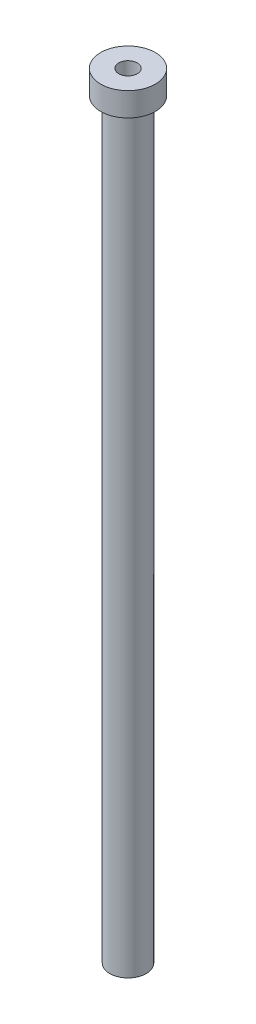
from build123d import *

# Parameters (mm, degrees)
M2_5_GEWINDEBOHRUNG1_D               = 2.05
M2_5_GEWINDEBOHRUNG1_DEPTH           = 7.25
M2_5_GEWINDEBOHRUNG1_TIP             = 0.615882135
M2_5_GEWINDEBOHRUNG1_ON_FACE_2_D     = 2.05
M2_5_GEWINDEBOHRUNG1_ON_FACE_2_DEPTH = 7.25
M2_5_GEWINDEBOHRUNG1_ON_FACE_2_TIP   = 0.615882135


with BuildPart() as part:
    # Skizze3 → Rotation3 (revolve)
    with BuildSketch(Plane(origin=(0, 0, 0), x_dir=(0, 0, -1), z_dir=(1, 0, 0)), mode=Mode.PRIVATE) as rotation3_sk:
        Polygon((-2, -2.6), (-2, -85), (0, -85), (0, 0), (-3, 0), (-3, -2.6), align=None)
    revolve(rotation3_sk.sketch.rotate(Axis((0, -91.523412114, 0), (0, 1, 0)), 180), axis=Axis((0, -91.523412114, 0), (0, 1, 0)))

    # M2.5 Gewindebohrung1
    with Locations(Plane.ZX):
        with Locations((0, 0)):
            Hole(M2_5_GEWINDEBOHRUNG1_D / 2, depth=M2_5_GEWINDEBOHRUNG1_DEPTH)
            with Locations((0, 0, -(M2_5_GEWINDEBOHRUNG1_DEPTH + M2_5_GEWINDEBOHRUNG1_TIP / 2))):  # 118° drill point
                Cone(0, M2_5_GEWINDEBOHRUNG1_D / 2, M2_5_GEWINDEBOHRUNG1_TIP, mode=Mode.SUBTRACT)

    # M2.5 Gewindebohrung1 on face 2
    with Locations(Plane(origin=(0, -85, 0), x_dir=(0, 0, -1), z_dir=(0, -1, 0))):
        with Locations((0, 0)):
            Hole(M2_5_GEWINDEBOHRUNG1_ON_FACE_2_D / 2, depth=M2_5_GEWINDEBOHRUNG1_ON_FACE_2_DEPTH)
            with Locations((0, 0, -(M2_5_GEWINDEBOHRUNG1_ON_FACE_2_DEPTH + M2_5_GEWINDEBOHRUNG1_ON_FACE_2_TIP / 2))):  # 118° drill point
                Cone(0, M2_5_GEWINDEBOHRUNG1_ON_FACE_2_D / 2, M2_5_GEWINDEBOHRUNG1_ON_FACE_2_TIP, mode=Mode.SUBTRACT)


solid = part.part
